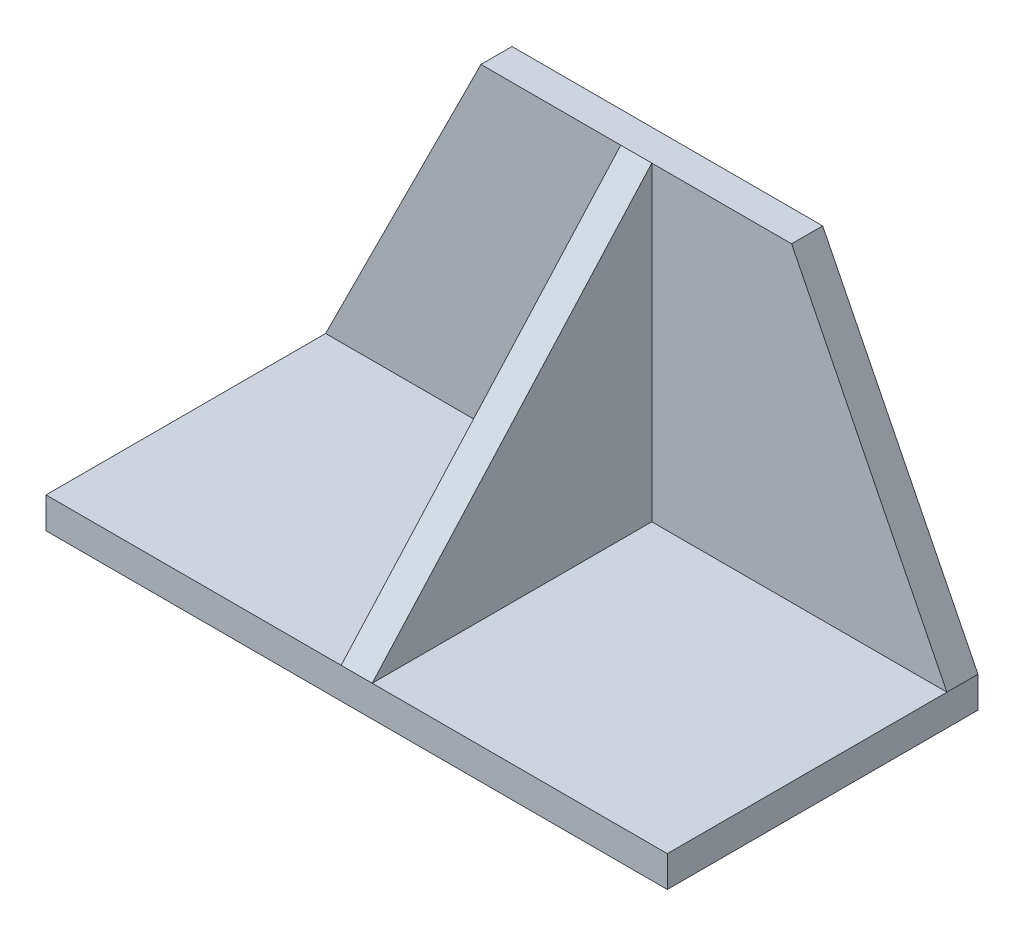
ISO-10303-21;
HEADER;
FILE_DESCRIPTION(('STEP AP214'),'2;1');
FILE_NAME('part.step','',(''),(''),'','','');
FILE_SCHEMA(('AUTOMOTIVE_DESIGN { 1 0 10303 214 1 1 1 1 }'));
ENDSEC;
DATA;
#1=APPLICATION_CONTEXT('core data for automotive mechanical design processes');
#2=APPLICATION_PROTOCOL_DEFINITION('international standard','automotive_design',2000,#1);
#3=PRODUCT_CONTEXT('',#1,'mechanical');
#4=PRODUCT('Part','Part','',(#3));
#5=PRODUCT_RELATED_PRODUCT_CATEGORY('part','',(#4));
#6=PRODUCT_DEFINITION_FORMATION('','',#4);
#7=PRODUCT_DEFINITION_CONTEXT('part definition',#1,'design');
#8=PRODUCT_DEFINITION('design','',#6,#7);
#9=PRODUCT_DEFINITION_SHAPE('','',#8);
#10=(LENGTH_UNIT() NAMED_UNIT(*) SI_UNIT(.MILLI.,.METRE.));
#11=(NAMED_UNIT(*) PLANE_ANGLE_UNIT() SI_UNIT($,.RADIAN.));
#12=(NAMED_UNIT(*) SI_UNIT($,.STERADIAN.) SOLID_ANGLE_UNIT());
#13=UNCERTAINTY_MEASURE_WITH_UNIT(LENGTH_MEASURE(1.E-05),#10,'distance_accuracy_value','');
#14=(GEOMETRIC_REPRESENTATION_CONTEXT(3) GLOBAL_UNCERTAINTY_ASSIGNED_CONTEXT((#13)) GLOBAL_UNIT_ASSIGNED_CONTEXT((#10,
#11,#12)) REPRESENTATION_CONTEXT('',''));
#15=CARTESIAN_POINT('',(0.,0.,0.));
#16=DIRECTION('',(0.,0.,1.));
#17=DIRECTION('',(1.,0.,0.));
#18=AXIS2_PLACEMENT_3D('',#15,#16,#17);
#19=CARTESIAN_POINT('',(-25.4,0.,-12.7));
#20=DIRECTION('',(0.,-1.,0.));
#21=DIRECTION('',(0.,0.,-1.));
#22=AXIS2_PLACEMENT_3D('',#19,#20,#21);
#23=PLANE('',#22);
#24=DIRECTION('',(0.,0.,1.));
#25=VECTOR('',#24,1.);
#26=CARTESIAN_POINT('',(-1.27,0.,-12.7));
#27=LINE('',#26,#25);
#28=CARTESIAN_POINT('',(-1.27,0.,-10.16));
#29=VERTEX_POINT('',#28);
#30=CARTESIAN_POINT('',(-1.27,0.,12.7));
#31=VERTEX_POINT('',#30);
#32=EDGE_CURVE('E103',#29,#31,#27,.T.);
#33=ORIENTED_EDGE('',*,*,#32,.F.);
#34=DIRECTION('',(-1.,0.,0.));
#35=VECTOR('',#34,1.);
#36=CARTESIAN_POINT('',(25.4,0.,-10.16));
#37=LINE('',#36,#35);
#38=CARTESIAN_POINT('',(-25.4,0.,-10.16));
#39=VERTEX_POINT('',#38);
#40=EDGE_CURVE('E52',#29,#39,#37,.T.);
#41=ORIENTED_EDGE('',*,*,#40,.T.);
#42=DIRECTION('',(0.,0.,1.));
#43=VECTOR('',#42,1.);
#44=CARTESIAN_POINT('',(-25.4,0.,12.7));
#45=LINE('',#44,#43);
#46=CARTESIAN_POINT('',(-25.4,0.,12.7));
#47=VERTEX_POINT('',#46);
#48=EDGE_CURVE('E129',#39,#47,#45,.T.);
#49=ORIENTED_EDGE('',*,*,#48,.T.);
#50=DIRECTION('',(1.,0.,0.));
#51=VECTOR('',#50,1.);
#52=CARTESIAN_POINT('',(-25.4,0.,12.7));
#53=LINE('',#52,#51);
#54=EDGE_CURVE('E123',#47,#31,#53,.T.);
#55=ORIENTED_EDGE('',*,*,#54,.T.);
#56=EDGE_LOOP('',(#33,#41,#49,#55));
#57=FACE_BOUND('',#56,.T.);
#58=ADVANCED_FACE('F29',(#57),#23,.F.);
#59=CARTESIAN_POINT('',(12.7,25.4,-10.16));
#60=DIRECTION('',(0.,0.,1.));
#61=DIRECTION('',(1.,0.,0.));
#62=AXIS2_PLACEMENT_3D('',#59,#60,#61);
#63=PLANE('',#62);
#64=ORIENTED_EDGE('',*,*,#40,.F.);
#65=DIRECTION('',(0.,1.,0.));
#66=VECTOR('',#65,1.);
#67=CARTESIAN_POINT('',(-1.27,25.4,-10.16));
#68=LINE('',#67,#66);
#69=CARTESIAN_POINT('',(-1.27,25.4,-10.16));
#70=VERTEX_POINT('',#69);
#71=EDGE_CURVE('E37',#29,#70,#68,.T.);
#72=ORIENTED_EDGE('',*,*,#71,.T.);
#73=DIRECTION('',(1.,0.,0.));
#74=VECTOR('',#73,1.);
#75=CARTESIAN_POINT('',(12.7,25.4,-10.16));
#76=LINE('',#75,#74);
#77=CARTESIAN_POINT('',(-12.7,25.4,-10.16));
#78=VERTEX_POINT('',#77);
#79=EDGE_CURVE('E158',#78,#70,#76,.T.);
#80=ORIENTED_EDGE('',*,*,#79,.F.);
#81=DIRECTION('',(0.447213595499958,0.894427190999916,0.));
#82=VECTOR('',#81,1.);
#83=CARTESIAN_POINT('',(-12.7,25.4,-10.16));
#84=LINE('',#83,#82);
#85=EDGE_CURVE('E151',#39,#78,#84,.T.);
#86=ORIENTED_EDGE('',*,*,#85,.F.);
#87=EDGE_LOOP('',(#64,#72,#80,#86));
#88=FACE_BOUND('',#87,.T.);
#89=ADVANCED_FACE('F218',(#88),#63,.T.);
#90=CARTESIAN_POINT('',(-25.4,-2.54,12.7));
#91=DIRECTION('',(-1.,0.,0.));
#92=DIRECTION('',(0.,0.,1.));
#93=AXIS2_PLACEMENT_3D('',#90,#91,#92);
#94=PLANE('',#93);
#95=CARTESIAN_POINT('',(-25.4,0.,-12.7));
#96=VERTEX_POINT('',#95);
#97=EDGE_CURVE('E136',#96,#39,#45,.T.);
#98=ORIENTED_EDGE('',*,*,#97,.F.);
#99=DIRECTION('',(0.,1.,0.));
#100=VECTOR('',#99,1.);
#101=CARTESIAN_POINT('',(-25.4,-2.54,-12.7));
#102=LINE('',#101,#100);
#103=CARTESIAN_POINT('',(-25.4,-2.54,-12.7));
#104=VERTEX_POINT('',#103);
#105=EDGE_CURVE('E166',#104,#96,#102,.T.);
#106=ORIENTED_EDGE('',*,*,#105,.F.);
#107=DIRECTION('',(0.,0.,1.));
#108=VECTOR('',#107,1.);
#109=CARTESIAN_POINT('',(-25.4,-2.54,12.7));
#110=LINE('',#109,#108);
#111=CARTESIAN_POINT('',(-25.4,-2.54,12.7));
#112=VERTEX_POINT('',#111);
#113=EDGE_CURVE('E134',#104,#112,#110,.T.);
#114=ORIENTED_EDGE('',*,*,#113,.T.);
#115=DIRECTION('',(0.,1.,0.));
#116=VECTOR('',#115,1.);
#117=CARTESIAN_POINT('',(-25.4,-2.54,12.7));
#118=LINE('',#117,#116);
#119=EDGE_CURVE('E185',#112,#47,#118,.T.);
#120=ORIENTED_EDGE('',*,*,#119,.T.);
#121=ORIENTED_EDGE('',*,*,#48,.F.);
#122=EDGE_LOOP('',(#98,#106,#114,#120,#121));
#123=FACE_BOUND('',#122,.T.);
#124=ADVANCED_FACE('F31',(#123),#94,.T.);
#125=CARTESIAN_POINT('',(-25.4,-2.54,-12.7));
#126=DIRECTION('',(0.,0.,-1.));
#127=DIRECTION('',(-1.,0.,0.));
#128=AXIS2_PLACEMENT_3D('',#125,#126,#127);
#129=PLANE('',#128);
#130=DIRECTION('',(-1.,0.,0.));
#131=VECTOR('',#130,1.);
#132=CARTESIAN_POINT('',(-25.4,-2.54,-12.7));
#133=LINE('',#132,#131);
#134=CARTESIAN_POINT('',(25.4,-2.54,-12.7));
#135=VERTEX_POINT('',#134);
#136=EDGE_CURVE('E181',#135,#104,#133,.T.);
#137=ORIENTED_EDGE('',*,*,#136,.T.);
#138=ORIENTED_EDGE('',*,*,#105,.T.);
#139=DIRECTION('',(0.447213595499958,0.894427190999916,0.));
#140=VECTOR('',#139,1.);
#141=CARTESIAN_POINT('',(-12.7,25.4,-12.7));
#142=LINE('',#141,#140);
#143=CARTESIAN_POINT('',(-12.7,25.4,-12.7));
#144=VERTEX_POINT('',#143);
#145=EDGE_CURVE('E207',#96,#144,#142,.T.);
#146=ORIENTED_EDGE('',*,*,#145,.T.);
#147=DIRECTION('',(1.,0.,0.));
#148=VECTOR('',#147,1.);
#149=CARTESIAN_POINT('',(12.7,25.4,-12.7));
#150=LINE('',#149,#148);
#151=CARTESIAN_POINT('',(12.7,25.4,-12.7));
#152=VERTEX_POINT('',#151);
#153=EDGE_CURVE('E156',#144,#152,#150,.T.);
#154=ORIENTED_EDGE('',*,*,#153,.T.);
#155=DIRECTION('',(0.447213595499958,-0.894427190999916,0.));
#156=VECTOR('',#155,1.);
#157=CARTESIAN_POINT('',(25.4,0.,-12.7));
#158=LINE('',#157,#156);
#159=CARTESIAN_POINT('',(25.4,0.,-12.7));
#160=VERTEX_POINT('',#159);
#161=EDGE_CURVE('E126',#152,#160,#158,.T.);
#162=ORIENTED_EDGE('',*,*,#161,.T.);
#163=DIRECTION('',(0.,1.,0.));
#164=VECTOR('',#163,1.);
#165=CARTESIAN_POINT('',(25.4,-2.54,-12.7));
#166=LINE('',#165,#164);
#167=EDGE_CURVE('E171',#135,#160,#166,.T.);
#168=ORIENTED_EDGE('',*,*,#167,.F.);
#169=EDGE_LOOP('',(#137,#138,#146,#154,#162,#168));
#170=FACE_BOUND('',#169,.T.);
#171=ADVANCED_FACE('F233',(#170),#129,.T.);
#172=CARTESIAN_POINT('',(25.4,-2.54,12.7));
#173=DIRECTION('',(1.,0.,0.));
#174=DIRECTION('',(0.,0.,-1.));
#175=AXIS2_PLACEMENT_3D('',#172,#173,#174);
#176=PLANE('',#175);
#177=DIRECTION('',(0.,0.,-1.));
#178=VECTOR('',#177,1.);
#179=CARTESIAN_POINT('',(25.4,0.,12.7));
#180=LINE('',#179,#178);
#181=CARTESIAN_POINT('',(25.4,0.,12.7));
#182=VERTEX_POINT('',#181);
#183=CARTESIAN_POINT('',(25.4,0.,-10.16));
#184=VERTEX_POINT('',#183);
#185=EDGE_CURVE('E131',#182,#184,#180,.T.);
#186=ORIENTED_EDGE('',*,*,#185,.F.);
#187=DIRECTION('',(0.,1.,0.));
#188=VECTOR('',#187,1.);
#189=CARTESIAN_POINT('',(25.4,-2.54,12.7));
#190=LINE('',#189,#188);
#191=CARTESIAN_POINT('',(25.4,-2.54,12.7));
#192=VERTEX_POINT('',#191);
#193=EDGE_CURVE('E178',#192,#182,#190,.T.);
#194=ORIENTED_EDGE('',*,*,#193,.F.);
#195=DIRECTION('',(0.,0.,-1.));
#196=VECTOR('',#195,1.);
#197=CARTESIAN_POINT('',(25.4,-2.54,12.7));
#198=LINE('',#197,#196);
#199=EDGE_CURVE('E231',#192,#135,#198,.T.);
#200=ORIENTED_EDGE('',*,*,#199,.T.);
#201=ORIENTED_EDGE('',*,*,#167,.T.);
#202=DIRECTION('',(0.,0.,-1.));
#203=VECTOR('',#202,1.);
#204=CARTESIAN_POINT('',(25.4,0.,-10.16));
#205=LINE('',#204,#203);
#206=EDGE_CURVE('E194',#184,#160,#205,.T.);
#207=ORIENTED_EDGE('',*,*,#206,.F.);
#208=EDGE_LOOP('',(#186,#194,#200,#201,#207));
#209=FACE_BOUND('',#208,.T.);
#210=ADVANCED_FACE('F235',(#209),#176,.T.);
#211=CARTESIAN_POINT('',(-25.4,-2.54,12.7));
#212=DIRECTION('',(0.,0.,1.));
#213=DIRECTION('',(1.,0.,0.));
#214=AXIS2_PLACEMENT_3D('',#211,#212,#213);
#215=PLANE('',#214);
#216=CARTESIAN_POINT('',(1.27,0.,12.7));
#217=VERTEX_POINT('',#216);
#218=EDGE_CURVE('E125',#217,#182,#53,.T.);
#219=ORIENTED_EDGE('',*,*,#218,.F.);
#220=DIRECTION('',(1.,0.,0.));
#221=VECTOR('',#220,1.);
#222=CARTESIAN_POINT('',(-25.4,0.,12.7));
#223=LINE('',#222,#221);
#224=EDGE_CURVE('E114',#217,#31,#223,.F.);
#225=ORIENTED_EDGE('',*,*,#224,.T.);
#226=ORIENTED_EDGE('',*,*,#54,.F.);
#227=ORIENTED_EDGE('',*,*,#119,.F.);
#228=DIRECTION('',(1.,0.,0.));
#229=VECTOR('',#228,1.);
#230=CARTESIAN_POINT('',(-25.4,-2.54,12.7));
#231=LINE('',#230,#229);
#232=EDGE_CURVE('E224',#112,#192,#231,.T.);
#233=ORIENTED_EDGE('',*,*,#232,.T.);
#234=ORIENTED_EDGE('',*,*,#193,.T.);
#235=EDGE_LOOP('',(#219,#225,#226,#227,#233,#234));
#236=FACE_BOUND('',#235,.T.);
#237=ADVANCED_FACE('F122',(#236),#215,.T.);
#238=CARTESIAN_POINT('',(-25.4,-2.54,-12.7));
#239=DIRECTION('',(0.,-1.,0.));
#240=DIRECTION('',(0.,0.,-1.));
#241=AXIS2_PLACEMENT_3D('',#238,#239,#240);
#242=PLANE('',#241);
#243=ORIENTED_EDGE('',*,*,#199,.F.);
#244=ORIENTED_EDGE('',*,*,#232,.F.);
#245=ORIENTED_EDGE('',*,*,#113,.F.);
#246=ORIENTED_EDGE('',*,*,#136,.F.);
#247=EDGE_LOOP('',(#243,#244,#245,#246));
#248=FACE_BOUND('',#247,.T.);
#249=ADVANCED_FACE('F228',(#248),#242,.T.);
#250=CARTESIAN_POINT('',(1.27,0.,-10.16));
#251=VERTEX_POINT('',#250);
#252=EDGE_CURVE('E147',#184,#251,#37,.T.);
#253=ORIENTED_EDGE('',*,*,#252,.T.);
#254=DIRECTION('',(0.,0.,1.));
#255=VECTOR('',#254,1.);
#256=CARTESIAN_POINT('',(1.27,0.,-12.7));
#257=LINE('',#256,#255);
#258=EDGE_CURVE('E107',#251,#217,#257,.T.);
#259=ORIENTED_EDGE('',*,*,#258,.T.);
#260=ORIENTED_EDGE('',*,*,#218,.T.);
#261=ORIENTED_EDGE('',*,*,#185,.T.);
#262=EDGE_LOOP('',(#253,#259,#260,#261));
#263=FACE_BOUND('',#262,.T.);
#264=ADVANCED_FACE('F237',(#263),#23,.F.);
#265=CARTESIAN_POINT('',(25.4,0.,-10.16));
#266=DIRECTION('',(0.894427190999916,0.447213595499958,0.));
#267=DIRECTION('',(-0.447213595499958,0.894427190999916,0.));
#268=AXIS2_PLACEMENT_3D('',#265,#266,#267);
#269=PLANE('',#268);
#270=ORIENTED_EDGE('',*,*,#161,.F.);
#271=DIRECTION('',(0.,0.,-1.));
#272=VECTOR('',#271,1.);
#273=CARTESIAN_POINT('',(12.7,25.4,-10.16));
#274=LINE('',#273,#272);
#275=CARTESIAN_POINT('',(12.7,25.4,-10.16));
#276=VERTEX_POINT('',#275);
#277=EDGE_CURVE('E186',#276,#152,#274,.T.);
#278=ORIENTED_EDGE('',*,*,#277,.F.);
#279=DIRECTION('',(0.447213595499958,-0.894427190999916,0.));
#280=VECTOR('',#279,1.);
#281=CARTESIAN_POINT('',(25.4,0.,-10.16));
#282=LINE('',#281,#280);
#283=EDGE_CURVE('E163',#276,#184,#282,.T.);
#284=ORIENTED_EDGE('',*,*,#283,.T.);
#285=ORIENTED_EDGE('',*,*,#206,.T.);
#286=EDGE_LOOP('',(#270,#278,#284,#285));
#287=FACE_BOUND('',#286,.T.);
#288=ADVANCED_FACE('F257',(#287),#269,.T.);
#289=CARTESIAN_POINT('',(12.7,25.4,-10.16));
#290=DIRECTION('',(0.,1.,0.));
#291=DIRECTION('',(0.,0.,1.));
#292=AXIS2_PLACEMENT_3D('',#289,#290,#291);
#293=PLANE('',#292);
#294=ORIENTED_EDGE('',*,*,#277,.T.);
#295=ORIENTED_EDGE('',*,*,#153,.F.);
#296=DIRECTION('',(0.,0.,-1.));
#297=VECTOR('',#296,1.);
#298=CARTESIAN_POINT('',(-12.7,25.4,-10.16));
#299=LINE('',#298,#297);
#300=EDGE_CURVE('E189',#78,#144,#299,.T.);
#301=ORIENTED_EDGE('',*,*,#300,.F.);
#302=ORIENTED_EDGE('',*,*,#79,.T.);
#303=CARTESIAN_POINT('',(1.27,25.4,-10.16));
#304=VERTEX_POINT('',#303);
#305=EDGE_CURVE('E117',#70,#304,#76,.T.);
#306=ORIENTED_EDGE('',*,*,#305,.T.);
#307=EDGE_CURVE('E202',#304,#276,#76,.T.);
#308=ORIENTED_EDGE('',*,*,#307,.T.);
#309=EDGE_LOOP('',(#294,#295,#301,#302,#306,#308));
#310=FACE_BOUND('',#309,.T.);
#311=ADVANCED_FACE('F217',(#310),#293,.T.);
#312=CARTESIAN_POINT('',(-12.7,25.4,-10.16));
#313=DIRECTION('',(-0.894427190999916,0.447213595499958,0.));
#314=DIRECTION('',(-0.447213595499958,-0.894427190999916,0.));
#315=AXIS2_PLACEMENT_3D('',#312,#313,#314);
#316=PLANE('',#315);
#317=ORIENTED_EDGE('',*,*,#145,.F.);
#318=ORIENTED_EDGE('',*,*,#97,.T.);
#319=ORIENTED_EDGE('',*,*,#85,.T.);
#320=ORIENTED_EDGE('',*,*,#300,.T.);
#321=EDGE_LOOP('',(#317,#318,#319,#320));
#322=FACE_BOUND('',#321,.T.);
#323=ADVANCED_FACE('F219',(#322),#316,.T.);
#324=DIRECTION('',(0.,1.,0.));
#325=VECTOR('',#324,1.);
#326=CARTESIAN_POINT('',(1.27,25.4,-10.16));
#327=LINE('',#326,#325);
#328=EDGE_CURVE('E11',#251,#304,#327,.T.);
#329=ORIENTED_EDGE('',*,*,#328,.F.);
#330=ORIENTED_EDGE('',*,*,#252,.F.);
#331=ORIENTED_EDGE('',*,*,#283,.F.);
#332=ORIENTED_EDGE('',*,*,#307,.F.);
#333=EDGE_LOOP('',(#329,#330,#331,#332));
#334=FACE_BOUND('',#333,.T.);
#335=ADVANCED_FACE('F216',(#334),#63,.T.);
#336=CARTESIAN_POINT('',(0.,0.,12.7));
#337=DIRECTION('',(0.,-0.66896473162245,-0.743294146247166));
#338=DIRECTION('',(0.,0.743294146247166,-0.66896473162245));
#339=AXIS2_PLACEMENT_3D('',#336,#337,#338);
#340=PLANE('',#339);
#341=ORIENTED_EDGE('',*,*,#224,.F.);
#342=DIRECTION('',(0.,0.743294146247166,-0.66896473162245));
#343=VECTOR('',#342,1.);
#344=CARTESIAN_POINT('',(1.27,0.,12.7));
#345=LINE('',#344,#343);
#346=EDGE_CURVE('E108',#217,#304,#345,.T.);
#347=ORIENTED_EDGE('',*,*,#346,.T.);
#348=ORIENTED_EDGE('',*,*,#305,.F.);
#349=DIRECTION('',(0.,0.743294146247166,-0.66896473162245));
#350=VECTOR('',#349,1.);
#351=CARTESIAN_POINT('',(-1.27,0.,12.7));
#352=LINE('',#351,#350);
#353=EDGE_CURVE('E44',#31,#70,#352,.T.);
#354=ORIENTED_EDGE('',*,*,#353,.F.);
#355=EDGE_LOOP('',(#341,#347,#348,#354));
#356=FACE_BOUND('',#355,.T.);
#357=ADVANCED_FACE('F112',(#356),#340,.F.);
#358=CARTESIAN_POINT('',(1.27,11.4300125,0.));
#359=DIRECTION('',(1.,0.,0.));
#360=DIRECTION('',(0.,0.,-1.));
#361=AXIS2_PLACEMENT_3D('',#358,#359,#360);
#362=PLANE('',#361);
#363=ORIENTED_EDGE('',*,*,#258,.F.);
#364=ORIENTED_EDGE('',*,*,#328,.T.);
#365=ORIENTED_EDGE('',*,*,#346,.F.);
#366=EDGE_LOOP('',(#363,#364,#365));
#367=FACE_BOUND('',#366,.T.);
#368=ADVANCED_FACE('F238',(#367),#362,.T.);
#369=CARTESIAN_POINT('',(-1.27,11.4300125,0.));
#370=DIRECTION('',(1.,0.,0.));
#371=DIRECTION('',(0.,0.,-1.));
#372=AXIS2_PLACEMENT_3D('',#369,#370,#371);
#373=PLANE('',#372);
#374=ORIENTED_EDGE('',*,*,#71,.F.);
#375=ORIENTED_EDGE('',*,*,#32,.T.);
#376=ORIENTED_EDGE('',*,*,#353,.T.);
#377=EDGE_LOOP('',(#374,#375,#376));
#378=FACE_BOUND('',#377,.T.);
#379=ADVANCED_FACE('F104',(#378),#373,.F.);
#380=CLOSED_SHELL('',(#58,#89,#124,#171,#210,#237,#249,#264,#288,#311,#323,#335,#357,#368,#379));
#381=MANIFOLD_SOLID_BREP('B2',#380);
#382=ADVANCED_BREP_SHAPE_REPRESENTATION('',(#18,#381),#14);
#383=SHAPE_DEFINITION_REPRESENTATION(#9,#382);
ENDSEC;
END-ISO-10303-21;
